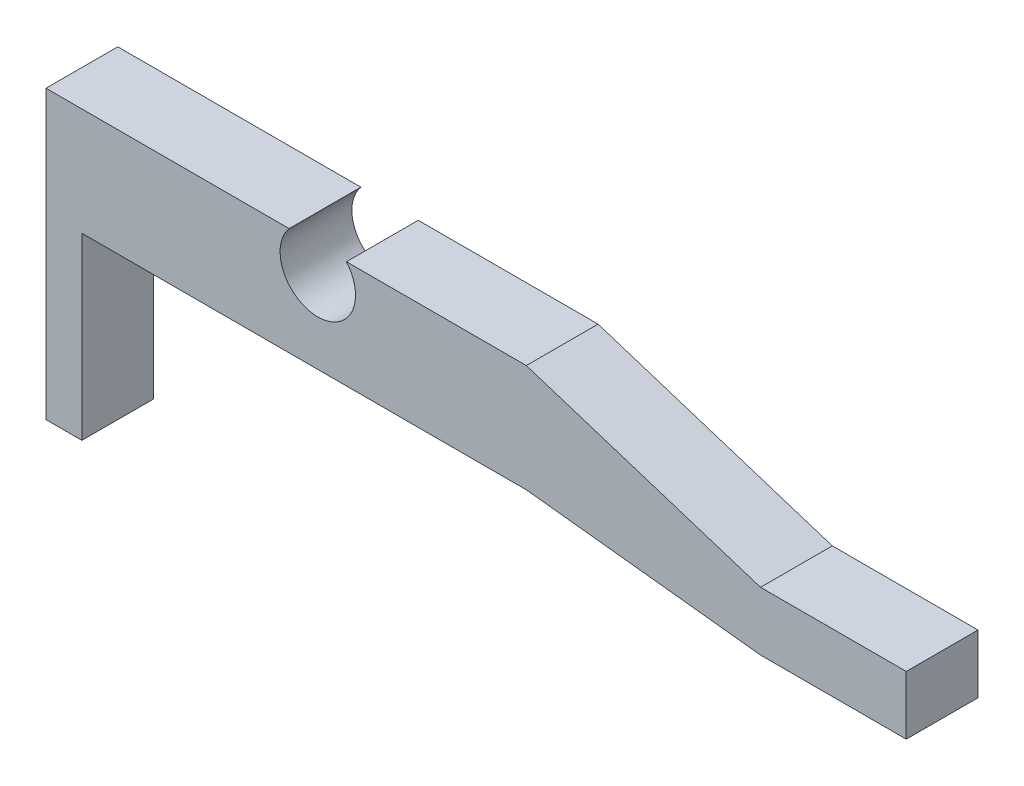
from build123d import *

# Parameters (mm, degrees)
AUFSATZ_LINEAR_AUSTRAGEN1_DEPTH = 20


with BuildPart() as part:
    # Skizze1 → Aufsatz-Linear austragen1 (new body)
    with BuildSketch(Plane.XY):
        with BuildLine():
            Line((-93.783403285, 46.321767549), (-26.01698549, 46.321767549))
            ThreePointArc((-26.01698549, 46.321767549), (-18.024673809, 28.991369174), (-10.032362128, 46.321767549))
            Line((-10.032362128, 46.321767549), (40.09846257, 46.321767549))
            Line((40.09846257, 46.321767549), (105.375029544, 25.433266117))
            Line((105.375029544, 25.433266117), (145.992720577, 25.433266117))
            Line((145.992720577, 25.433266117), (145.992720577, 9.077187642))
            Line((145.992720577, 9.077187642), (105.375029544, 9.077187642))
            Line((105.375029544, 9.077187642), (40.09846257, 16.321767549))
            Line((40.09846257, 16.321767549), (-83.783403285, 16.321767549))
            Line((-83.783403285, 16.321767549), (-83.783403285, -33.678232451))
            Line((-83.783403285, -33.678232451), (-93.783403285, -33.678232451))
            Line((-93.783403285, -33.678232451), (-93.783403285, 46.321767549))
        make_face()
    extrude(amount=AUFSATZ_LINEAR_AUSTRAGEN1_DEPTH)


solid = part.part
